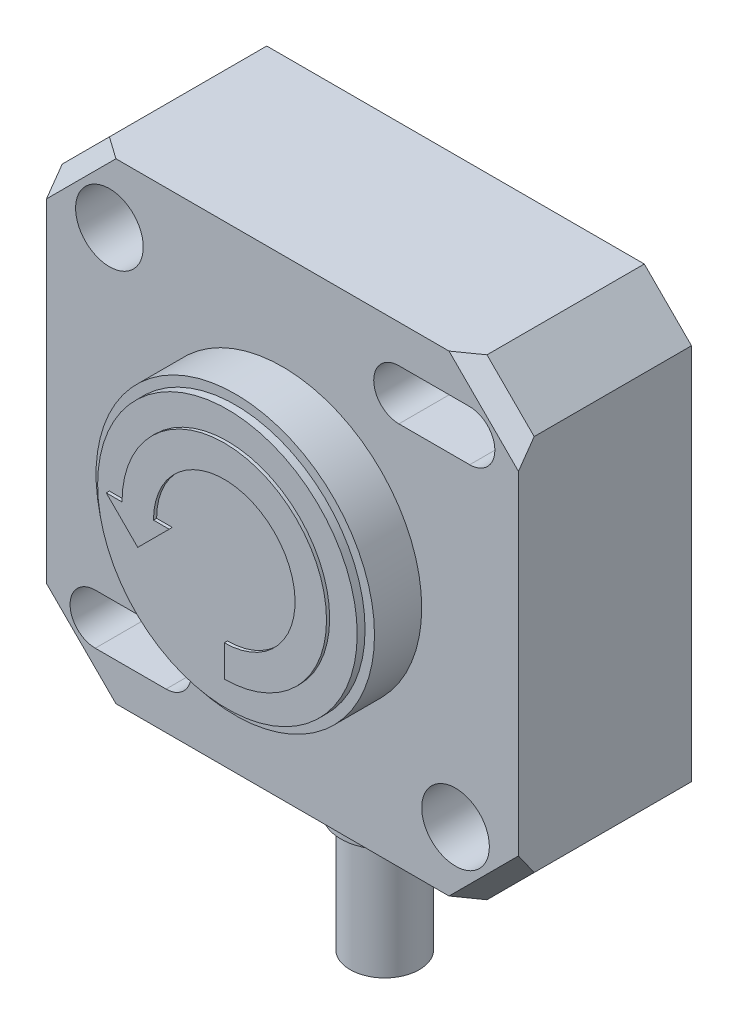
ISO-10303-21;
HEADER;
FILE_DESCRIPTION(('STEP AP214'),'2;1');
FILE_NAME('part.step','',(''),(''),'','','');
FILE_SCHEMA(('AUTOMOTIVE_DESIGN { 1 0 10303 214 1 1 1 1 }'));
ENDSEC;
DATA;
#1=APPLICATION_CONTEXT('core data for automotive mechanical design processes');
#2=APPLICATION_PROTOCOL_DEFINITION('international standard','automotive_design',2000,#1);
#3=PRODUCT_CONTEXT('',#1,'mechanical');
#4=PRODUCT('Part','Part','',(#3));
#5=PRODUCT_RELATED_PRODUCT_CATEGORY('part','',(#4));
#6=PRODUCT_DEFINITION_FORMATION('','',#4);
#7=PRODUCT_DEFINITION_CONTEXT('part definition',#1,'design');
#8=PRODUCT_DEFINITION('design','',#6,#7);
#9=PRODUCT_DEFINITION_SHAPE('','',#8);
#10=(LENGTH_UNIT() NAMED_UNIT(*) SI_UNIT(.MILLI.,.METRE.));
#11=(NAMED_UNIT(*) PLANE_ANGLE_UNIT() SI_UNIT($,.RADIAN.));
#12=(NAMED_UNIT(*) SI_UNIT($,.STERADIAN.) SOLID_ANGLE_UNIT());
#13=UNCERTAINTY_MEASURE_WITH_UNIT(LENGTH_MEASURE(1.E-05),#10,'distance_accuracy_value','');
#14=(GEOMETRIC_REPRESENTATION_CONTEXT(3) GLOBAL_UNCERTAINTY_ASSIGNED_CONTEXT((#13)) GLOBAL_UNIT_ASSIGNED_CONTEXT((#10,
#11,#12)) REPRESENTATION_CONTEXT('',''));
#15=CARTESIAN_POINT('',(0.,0.,0.));
#16=DIRECTION('',(0.,0.,1.));
#17=DIRECTION('',(1.,0.,0.));
#18=AXIS2_PLACEMENT_3D('',#15,#16,#17);
#19=CARTESIAN_POINT('',(0.,0.,14.7));
#20=DIRECTION('',(0.,0.,1.));
#21=DIRECTION('',(1.,0.,0.));
#22=AXIS2_PLACEMENT_3D('',#19,#20,#21);
#23=PLANE('',#22);
#24=DIRECTION('',(-1.,0.,0.));
#25=VECTOR('',#24,1.);
#26=CARTESIAN_POINT('',(-4.5,0.,14.7));
#27=LINE('',#26,#25);
#28=CARTESIAN_POINT('',(-4.5,0.,14.7));
#29=VERTEX_POINT('',#28);
#30=CARTESIAN_POINT('',(-3.5,0.,14.7));
#31=VERTEX_POINT('',#30);
#32=EDGE_CURVE('E110',#29,#31,#27,.F.);
#33=ORIENTED_EDGE('',*,*,#32,.F.);
#34=CARTESIAN_POINT('',(0.,0.,14.7));
#35=DIRECTION('',(0.,0.,1.));
#36=DIRECTION('',(1.,0.,0.));
#37=AXIS2_PLACEMENT_3D('',#34,#35,#36);
#38=CIRCLE('',#37,4.5);
#39=CARTESIAN_POINT('',(0.,-4.5,14.7));
#40=VERTEX_POINT('',#39);
#41=EDGE_CURVE('E19',#29,#40,#38,.F.);
#42=ORIENTED_EDGE('',*,*,#41,.T.);
#43=DIRECTION('',(0.,1.,0.));
#44=VECTOR('',#43,1.);
#45=CARTESIAN_POINT('',(0.,-4.5,14.7));
#46=LINE('',#45,#44);
#47=CARTESIAN_POINT('',(0.,-6.5,14.7));
#48=VERTEX_POINT('',#47);
#49=EDGE_CURVE('E158',#48,#40,#46,.T.);
#50=ORIENTED_EDGE('',*,*,#49,.F.);
#51=CARTESIAN_POINT('',(0.,0.,14.7));
#52=DIRECTION('',(0.,0.,1.));
#53=DIRECTION('',(1.,0.,0.));
#54=AXIS2_PLACEMENT_3D('',#51,#52,#53);
#55=CIRCLE('',#54,6.5);
#56=CARTESIAN_POINT('',(-6.5,0.,14.7));
#57=VERTEX_POINT('',#56);
#58=EDGE_CURVE('E143',#57,#48,#55,.F.);
#59=ORIENTED_EDGE('',*,*,#58,.F.);
#60=DIRECTION('',(-1.,0.,0.));
#61=VECTOR('',#60,1.);
#62=CARTESIAN_POINT('',(-6.5,0.,14.7));
#63=LINE('',#62,#61);
#64=CARTESIAN_POINT('',(-7.5,0.,14.7));
#65=VERTEX_POINT('',#64);
#66=EDGE_CURVE('E139',#65,#57,#63,.F.);
#67=ORIENTED_EDGE('',*,*,#66,.F.);
#68=DIRECTION('',(0.707106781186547,-0.707106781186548,0.));
#69=VECTOR('',#68,1.);
#70=CARTESIAN_POINT('',(-7.5,0.,14.7));
#71=LINE('',#70,#69);
#72=CARTESIAN_POINT('',(-5.5,-2.,14.7));
#73=VERTEX_POINT('',#72);
#74=EDGE_CURVE('E130',#73,#65,#71,.F.);
#75=ORIENTED_EDGE('',*,*,#74,.F.);
#76=DIRECTION('',(0.707106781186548,0.707106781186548,0.));
#77=VECTOR('',#76,1.);
#78=CARTESIAN_POINT('',(-3.5,0.,14.7));
#79=LINE('',#78,#77);
#80=EDGE_CURVE('E151',#31,#73,#79,.F.);
#81=ORIENTED_EDGE('',*,*,#80,.F.);
#82=EDGE_LOOP('',(#33,#42,#50,#59,#67,#75,#81));
#83=FACE_BOUND('',#82,.T.);
#84=ADVANCED_FACE('F16',(#83),#23,.T.);
#85=CARTESIAN_POINT('',(-6.5,0.,14.7));
#86=DIRECTION('',(0.,1.,0.));
#87=DIRECTION('',(-1.,0.,0.));
#88=AXIS2_PLACEMENT_3D('',#85,#86,#87);
#89=PLANE('',#88);
#90=ORIENTED_EDGE('',*,*,#66,.T.);
#91=DIRECTION('',(0.,0.,1.));
#92=VECTOR('',#91,1.);
#93=CARTESIAN_POINT('',(-6.5,0.,14.7));
#94=LINE('',#93,#92);
#95=CARTESIAN_POINT('',(-6.5,0.,14.5));
#96=VERTEX_POINT('',#95);
#97=EDGE_CURVE('E259',#96,#57,#94,.T.);
#98=ORIENTED_EDGE('',*,*,#97,.F.);
#99=DIRECTION('',(-1.,0.,0.));
#100=VECTOR('',#99,1.);
#101=CARTESIAN_POINT('',(0.,0.,14.5));
#102=LINE('',#101,#100);
#103=CARTESIAN_POINT('',(-7.5,0.,14.5));
#104=VERTEX_POINT('',#103);
#105=EDGE_CURVE('E150',#96,#104,#102,.T.);
#106=ORIENTED_EDGE('',*,*,#105,.T.);
#107=DIRECTION('',(0.,0.,1.));
#108=VECTOR('',#107,1.);
#109=CARTESIAN_POINT('',(-7.5,0.,14.7));
#110=LINE('',#109,#108);
#111=EDGE_CURVE('E135',#65,#104,#110,.F.);
#112=ORIENTED_EDGE('',*,*,#111,.F.);
#113=EDGE_LOOP('',(#90,#98,#106,#112));
#114=FACE_BOUND('',#113,.T.);
#115=ADVANCED_FACE('F149',(#114),#89,.T.);
#116=CARTESIAN_POINT('',(-7.5,0.,14.7));
#117=DIRECTION('',(-0.707106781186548,-0.707106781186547,0.));
#118=DIRECTION('',(0.707106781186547,-0.707106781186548,0.));
#119=AXIS2_PLACEMENT_3D('',#116,#117,#118);
#120=PLANE('',#119);
#121=ORIENTED_EDGE('',*,*,#74,.T.);
#122=ORIENTED_EDGE('',*,*,#111,.T.);
#123=DIRECTION('',(0.707106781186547,-0.707106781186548,0.));
#124=VECTOR('',#123,1.);
#125=CARTESIAN_POINT('',(-7.5,0.,14.5));
#126=LINE('',#125,#124);
#127=CARTESIAN_POINT('',(-5.5,-2.,14.5));
#128=VERTEX_POINT('',#127);
#129=EDGE_CURVE('E156',#104,#128,#126,.T.);
#130=ORIENTED_EDGE('',*,*,#129,.T.);
#131=DIRECTION('',(0.,0.,1.));
#132=VECTOR('',#131,1.);
#133=CARTESIAN_POINT('',(-5.5,-2.,14.7));
#134=LINE('',#133,#132);
#135=EDGE_CURVE('E138',#73,#128,#134,.F.);
#136=ORIENTED_EDGE('',*,*,#135,.F.);
#137=EDGE_LOOP('',(#121,#122,#130,#136));
#138=FACE_BOUND('',#137,.T.);
#139=ADVANCED_FACE('F132',(#138),#120,.T.);
#140=CARTESIAN_POINT('',(-3.5,0.,14.7));
#141=DIRECTION('',(0.707106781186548,-0.707106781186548,0.));
#142=DIRECTION('',(0.707106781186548,0.707106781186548,0.));
#143=AXIS2_PLACEMENT_3D('',#140,#141,#142);
#144=PLANE('',#143);
#145=ORIENTED_EDGE('',*,*,#80,.T.);
#146=ORIENTED_EDGE('',*,*,#135,.T.);
#147=DIRECTION('',(0.707106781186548,0.707106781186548,0.));
#148=VECTOR('',#147,1.);
#149=CARTESIAN_POINT('',(-5.5,-2.,14.5));
#150=LINE('',#149,#148);
#151=CARTESIAN_POINT('',(-3.5,0.,14.5));
#152=VERTEX_POINT('',#151);
#153=EDGE_CURVE('E269',#128,#152,#150,.T.);
#154=ORIENTED_EDGE('',*,*,#153,.T.);
#155=DIRECTION('',(0.,0.,1.));
#156=VECTOR('',#155,1.);
#157=CARTESIAN_POINT('',(-3.5,0.,14.7));
#158=LINE('',#157,#156);
#159=EDGE_CURVE('E161',#31,#152,#158,.F.);
#160=ORIENTED_EDGE('',*,*,#159,.F.);
#161=EDGE_LOOP('',(#145,#146,#154,#160));
#162=FACE_BOUND('',#161,.T.);
#163=ADVANCED_FACE('F273',(#162),#144,.T.);
#164=CARTESIAN_POINT('',(-4.5,0.,14.7));
#165=DIRECTION('',(0.,1.,0.));
#166=DIRECTION('',(-1.,0.,0.));
#167=AXIS2_PLACEMENT_3D('',#164,#165,#166);
#168=PLANE('',#167);
#169=ORIENTED_EDGE('',*,*,#32,.T.);
#170=ORIENTED_EDGE('',*,*,#159,.T.);
#171=DIRECTION('',(-1.,0.,0.));
#172=VECTOR('',#171,1.);
#173=CARTESIAN_POINT('',(0.,0.,14.5));
#174=LINE('',#173,#172);
#175=CARTESIAN_POINT('',(-4.5,0.,14.5));
#176=VERTEX_POINT('',#175);
#177=EDGE_CURVE('E257',#152,#176,#174,.T.);
#178=ORIENTED_EDGE('',*,*,#177,.T.);
#179=DIRECTION('',(0.,0.,1.));
#180=VECTOR('',#179,1.);
#181=CARTESIAN_POINT('',(-4.5,0.,14.7));
#182=LINE('',#181,#180);
#183=EDGE_CURVE('E266',#176,#29,#182,.T.);
#184=ORIENTED_EDGE('',*,*,#183,.T.);
#185=EDGE_LOOP('',(#169,#170,#178,#184));
#186=FACE_BOUND('',#185,.T.);
#187=ADVANCED_FACE('F633',(#186),#168,.T.);
#188=CARTESIAN_POINT('',(0.,0.,14.7));
#189=DIRECTION('',(0.,0.,1.));
#190=DIRECTION('',(1.,0.,0.));
#191=AXIS2_PLACEMENT_3D('',#188,#189,#190);
#192=CYLINDRICAL_SURFACE('',#191,4.5);
#193=DIRECTION('',(0.,0.,1.));
#194=VECTOR('',#193,1.);
#195=CARTESIAN_POINT('',(0.,-4.5,14.7));
#196=LINE('',#195,#194);
#197=CARTESIAN_POINT('',(0.,-4.5,14.5));
#198=VERTEX_POINT('',#197);
#199=EDGE_CURVE('E159',#40,#198,#196,.F.);
#200=ORIENTED_EDGE('',*,*,#199,.F.);
#201=ORIENTED_EDGE('',*,*,#41,.F.);
#202=ORIENTED_EDGE('',*,*,#183,.F.);
#203=CARTESIAN_POINT('',(0.,0.,14.5));
#204=DIRECTION('',(0.,0.,1.));
#205=DIRECTION('',(1.,0.,0.));
#206=AXIS2_PLACEMENT_3D('',#203,#204,#205);
#207=CIRCLE('',#206,4.5);
#208=EDGE_CURVE('E255',#176,#198,#207,.F.);
#209=ORIENTED_EDGE('',*,*,#208,.T.);
#210=EDGE_LOOP('',(#200,#201,#202,#209));
#211=FACE_BOUND('',#210,.T.);
#212=ADVANCED_FACE('F636',(#211),#192,.F.);
#213=CARTESIAN_POINT('',(0.,-4.5,14.7));
#214=DIRECTION('',(-1.,0.,0.));
#215=DIRECTION('',(0.,0.,1.));
#216=AXIS2_PLACEMENT_3D('',#213,#214,#215);
#217=PLANE('',#216);
#218=ORIENTED_EDGE('',*,*,#49,.T.);
#219=ORIENTED_EDGE('',*,*,#199,.T.);
#220=DIRECTION('',(0.,1.,0.));
#221=VECTOR('',#220,1.);
#222=CARTESIAN_POINT('',(0.,0.,14.5));
#223=LINE('',#222,#221);
#224=CARTESIAN_POINT('',(0.,-6.5,14.5));
#225=VERTEX_POINT('',#224);
#226=EDGE_CURVE('E254',#198,#225,#223,.F.);
#227=ORIENTED_EDGE('',*,*,#226,.T.);
#228=DIRECTION('',(0.,0.,1.));
#229=VECTOR('',#228,1.);
#230=CARTESIAN_POINT('',(0.,-6.5,14.7));
#231=LINE('',#230,#229);
#232=EDGE_CURVE('E258',#48,#225,#231,.F.);
#233=ORIENTED_EDGE('',*,*,#232,.F.);
#234=EDGE_LOOP('',(#218,#219,#227,#233));
#235=FACE_BOUND('',#234,.T.);
#236=ADVANCED_FACE('F640',(#235),#217,.T.);
#237=CARTESIAN_POINT('',(0.,0.,14.7));
#238=DIRECTION('',(0.,0.,1.));
#239=DIRECTION('',(1.,0.,0.));
#240=AXIS2_PLACEMENT_3D('',#237,#238,#239);
#241=CYLINDRICAL_SURFACE('',#240,6.5);
#242=ORIENTED_EDGE('',*,*,#58,.T.);
#243=ORIENTED_EDGE('',*,*,#232,.T.);
#244=CARTESIAN_POINT('',(0.,0.,14.5));
#245=DIRECTION('',(0.,0.,1.));
#246=DIRECTION('',(1.,0.,0.));
#247=AXIS2_PLACEMENT_3D('',#244,#245,#246);
#248=CIRCLE('',#247,6.5);
#249=EDGE_CURVE('E251',#225,#96,#248,.T.);
#250=ORIENTED_EDGE('',*,*,#249,.T.);
#251=ORIENTED_EDGE('',*,*,#97,.T.);
#252=EDGE_LOOP('',(#242,#243,#250,#251));
#253=FACE_BOUND('',#252,.T.);
#254=ADVANCED_FACE('F641',(#253),#241,.T.);
#255=CARTESIAN_POINT('',(0.,0.,14.5));
#256=DIRECTION('',(0.,0.,-1.));
#257=DIRECTION('',(-1.,0.,0.));
#258=AXIS2_PLACEMENT_3D('',#255,#256,#257);
#259=PLANE('',#258);
#260=CARTESIAN_POINT('',(0.,0.,14.5));
#261=DIRECTION('',(0.,0.,1.));
#262=DIRECTION('',(1.,0.,0.));
#263=AXIS2_PLACEMENT_3D('',#260,#261,#262);
#264=CIRCLE('',#263,8.25);
#265=CARTESIAN_POINT('',(8.25,0.,14.5));
#266=VERTEX_POINT('',#265);
#267=EDGE_CURVE('E248',#266,#266,#264,.F.);
#268=ORIENTED_EDGE('',*,*,#267,.F.);
#269=EDGE_LOOP('',(#268));
#270=FACE_BOUND('',#269,.T.);
#271=ORIENTED_EDGE('',*,*,#226,.F.);
#272=ORIENTED_EDGE('',*,*,#208,.F.);
#273=ORIENTED_EDGE('',*,*,#177,.F.);
#274=ORIENTED_EDGE('',*,*,#153,.F.);
#275=ORIENTED_EDGE('',*,*,#129,.F.);
#276=ORIENTED_EDGE('',*,*,#105,.F.);
#277=ORIENTED_EDGE('',*,*,#249,.F.);
#278=EDGE_LOOP('',(#271,#272,#273,#274,#275,#276,#277));
#279=FACE_BOUND('',#278,.T.);
#280=ADVANCED_FACE('F278',(#270,#279),#259,.F.);
#281=CARTESIAN_POINT('',(0.,-26.5,4.5));
#282=DIRECTION('',(0.,1.,0.));
#283=DIRECTION('',(0.,0.,1.));
#284=AXIS2_PLACEMENT_3D('',#281,#282,#283);
#285=PLANE('',#284);
#286=CARTESIAN_POINT('',(0.,-26.5,4.5));
#287=DIRECTION('',(0.,-1.,0.));
#288=DIRECTION('',(0.,0.,-1.));
#289=AXIS2_PLACEMENT_3D('',#286,#287,#288);
#290=CIRCLE('',#289,2.2);
#291=CARTESIAN_POINT('',(0.,-26.5,2.3));
#292=VERTEX_POINT('',#291);
#293=EDGE_CURVE('E245',#292,#292,#290,.F.);
#294=ORIENTED_EDGE('',*,*,#293,.F.);
#295=EDGE_LOOP('',(#294));
#296=FACE_BOUND('',#295,.T.);
#297=ADVANCED_FACE('F648',(#296),#285,.F.);
#298=CARTESIAN_POINT('',(0.,0.,14.5));
#299=DIRECTION('',(0.,0.,1.));
#300=DIRECTION('',(1.,0.,0.));
#301=AXIS2_PLACEMENT_3D('',#298,#299,#300);
#302=CYLINDRICAL_SURFACE('',#301,8.25);
#303=CARTESIAN_POINT('',(0.,0.,14.));
#304=DIRECTION('',(0.,0.,1.));
#305=DIRECTION('',(1.,0.,0.));
#306=AXIS2_PLACEMENT_3D('',#303,#304,#305);
#307=CIRCLE('',#306,8.25);
#308=CARTESIAN_POINT('',(8.25,0.,14.));
#309=VERTEX_POINT('',#308);
#310=EDGE_CURVE('E242',#309,#309,#307,.T.);
#311=ORIENTED_EDGE('',*,*,#310,.T.);
#312=EDGE_LOOP('',(#311));
#313=FACE_BOUND('',#312,.T.);
#314=ORIENTED_EDGE('',*,*,#267,.T.);
#315=EDGE_LOOP('',(#314));
#316=FACE_BOUND('',#315,.T.);
#317=ADVANCED_FACE('F725',(#313,#316),#302,.T.);
#318=CARTESIAN_POINT('',(0.,-26.5,4.5));
#319=DIRECTION('',(0.,-1.,0.));
#320=DIRECTION('',(0.,0.,-1.));
#321=AXIS2_PLACEMENT_3D('',#318,#319,#320);
#322=CYLINDRICAL_SURFACE('',#321,2.2);
#323=CARTESIAN_POINT('',(0.,-19.,4.5));
#324=DIRECTION('',(0.,-1.,0.));
#325=DIRECTION('',(0.,0.,-1.));
#326=AXIS2_PLACEMENT_3D('',#323,#324,#325);
#327=CIRCLE('',#326,2.2);
#328=CARTESIAN_POINT('',(0.,-19.,2.3));
#329=VERTEX_POINT('',#328);
#330=EDGE_CURVE('E239',#329,#329,#327,.T.);
#331=ORIENTED_EDGE('',*,*,#330,.T.);
#332=EDGE_LOOP('',(#331));
#333=FACE_BOUND('',#332,.T.);
#334=ORIENTED_EDGE('',*,*,#293,.T.);
#335=EDGE_LOOP('',(#334));
#336=FACE_BOUND('',#335,.T.);
#337=ADVANCED_FACE('F734',(#333,#336),#322,.T.);
#338=CARTESIAN_POINT('',(0.,0.,14.));
#339=DIRECTION('',(0.,0.,-1.));
#340=DIRECTION('',(-1.,0.,0.));
#341=AXIS2_PLACEMENT_3D('',#338,#339,#340);
#342=PLANE('',#341);
#343=CARTESIAN_POINT('',(0.,0.,14.));
#344=DIRECTION('',(0.,0.,1.));
#345=DIRECTION('',(1.,0.,0.));
#346=AXIS2_PLACEMENT_3D('',#343,#344,#345);
#347=CIRCLE('',#346,8.85);
#348=CARTESIAN_POINT('',(8.85,0.,14.));
#349=VERTEX_POINT('',#348);
#350=EDGE_CURVE('E236',#349,#349,#347,.F.);
#351=ORIENTED_EDGE('',*,*,#350,.F.);
#352=EDGE_LOOP('',(#351));
#353=FACE_BOUND('',#352,.T.);
#354=ORIENTED_EDGE('',*,*,#310,.F.);
#355=EDGE_LOOP('',(#354));
#356=FACE_BOUND('',#355,.T.);
#357=ADVANCED_FACE('F744',(#353,#356),#342,.F.);
#358=CARTESIAN_POINT('',(0.,-19.,4.5));
#359=DIRECTION('',(0.,1.,0.));
#360=DIRECTION('',(0.,0.,1.));
#361=AXIS2_PLACEMENT_3D('',#358,#359,#360);
#362=PLANE('',#361);
#363=CARTESIAN_POINT('',(0.,-19.,4.5));
#364=DIRECTION('',(0.,-1.,0.));
#365=DIRECTION('',(0.,0.,-1.));
#366=AXIS2_PLACEMENT_3D('',#363,#364,#365);
#367=CIRCLE('',#366,2.8);
#368=CARTESIAN_POINT('',(0.,-19.,1.7));
#369=VERTEX_POINT('',#368);
#370=EDGE_CURVE('E225',#369,#369,#367,.F.);
#371=ORIENTED_EDGE('',*,*,#370,.F.);
#372=EDGE_LOOP('',(#371));
#373=FACE_BOUND('',#372,.T.);
#374=ORIENTED_EDGE('',*,*,#330,.F.);
#375=EDGE_LOOP('',(#374));
#376=FACE_BOUND('',#375,.T.);
#377=ADVANCED_FACE('F450',(#373,#376),#362,.F.);
#378=CARTESIAN_POINT('',(-11.,11.,11.));
#379=DIRECTION('',(0.,0.,1.));
#380=DIRECTION('',(1.,0.,0.));
#381=AXIS2_PLACEMENT_3D('',#378,#379,#380);
#382=CYLINDRICAL_SURFACE('',#381,2.15);
#383=CARTESIAN_POINT('',(-11.,11.,11.));
#384=DIRECTION('',(0.,0.,1.));
#385=DIRECTION('',(1.,0.,0.));
#386=AXIS2_PLACEMENT_3D('',#383,#384,#385);
#387=CIRCLE('',#386,2.15);
#388=CARTESIAN_POINT('',(-8.85,11.,11.));
#389=VERTEX_POINT('',#388);
#390=EDGE_CURVE('E222',#389,#389,#387,.F.);
#391=ORIENTED_EDGE('',*,*,#390,.F.);
#392=EDGE_LOOP('',(#391));
#393=FACE_BOUND('',#392,.T.);
#394=CARTESIAN_POINT('',(-11.,11.,4.5));
#395=DIRECTION('',(0.,0.,1.));
#396=DIRECTION('',(1.,0.,0.));
#397=AXIS2_PLACEMENT_3D('',#394,#395,#396);
#398=CIRCLE('',#397,2.15);
#399=CARTESIAN_POINT('',(-8.85,11.,4.5));
#400=VERTEX_POINT('',#399);
#401=EDGE_CURVE('E233',#400,#400,#398,.F.);
#402=ORIENTED_EDGE('',*,*,#401,.T.);
#403=EDGE_LOOP('',(#402));
#404=FACE_BOUND('',#403,.T.);
#405=ADVANCED_FACE('F446',(#393,#404),#382,.F.);
#406=CARTESIAN_POINT('',(11.,-11.,11.));
#407=DIRECTION('',(0.,0.,1.));
#408=DIRECTION('',(1.,0.,0.));
#409=AXIS2_PLACEMENT_3D('',#406,#407,#408);
#410=CYLINDRICAL_SURFACE('',#409,2.15);
#411=CARTESIAN_POINT('',(11.,-11.,11.));
#412=DIRECTION('',(0.,0.,1.));
#413=DIRECTION('',(1.,0.,0.));
#414=AXIS2_PLACEMENT_3D('',#411,#412,#413);
#415=CIRCLE('',#414,2.15);
#416=CARTESIAN_POINT('',(13.15,-11.,11.));
#417=VERTEX_POINT('',#416);
#418=EDGE_CURVE('E219',#417,#417,#415,.F.);
#419=ORIENTED_EDGE('',*,*,#418,.F.);
#420=EDGE_LOOP('',(#419));
#421=FACE_BOUND('',#420,.T.);
#422=CARTESIAN_POINT('',(11.,-11.,4.5));
#423=DIRECTION('',(0.,0.,1.));
#424=DIRECTION('',(1.,0.,0.));
#425=AXIS2_PLACEMENT_3D('',#422,#423,#424);
#426=CIRCLE('',#425,2.15);
#427=CARTESIAN_POINT('',(13.15,-11.,4.5));
#428=VERTEX_POINT('',#427);
#429=EDGE_CURVE('E229',#428,#428,#426,.F.);
#430=ORIENTED_EDGE('',*,*,#429,.T.);
#431=EDGE_LOOP('',(#430));
#432=FACE_BOUND('',#431,.T.);
#433=ADVANCED_FACE('F449',(#421,#432),#410,.F.);
#434=CARTESIAN_POINT('',(0.,0.,14.));
#435=DIRECTION('',(0.,0.,1.));
#436=DIRECTION('',(1.,0.,0.));
#437=AXIS2_PLACEMENT_3D('',#434,#435,#436);
#438=CYLINDRICAL_SURFACE('',#437,8.85);
#439=CARTESIAN_POINT('',(0.,0.,11.));
#440=DIRECTION('',(0.,0.,1.));
#441=DIRECTION('',(1.,0.,0.));
#442=AXIS2_PLACEMENT_3D('',#439,#440,#441);
#443=CIRCLE('',#442,8.85);
#444=CARTESIAN_POINT('',(8.85,0.,11.));
#445=VERTEX_POINT('',#444);
#446=EDGE_CURVE('E215',#445,#445,#443,.F.);
#447=ORIENTED_EDGE('',*,*,#446,.F.);
#448=EDGE_LOOP('',(#447));
#449=FACE_BOUND('',#448,.T.);
#450=ORIENTED_EDGE('',*,*,#350,.T.);
#451=EDGE_LOOP('',(#450));
#452=FACE_BOUND('',#451,.T.);
#453=ADVANCED_FACE('F457',(#449,#452),#438,.T.);
#454=CARTESIAN_POINT('',(-11.,11.,4.5));
#455=DIRECTION('',(0.,0.,-1.));
#456=DIRECTION('',(-1.,0.,0.));
#457=AXIS2_PLACEMENT_3D('',#454,#455,#456);
#458=PLANE('',#457);
#459=CARTESIAN_POINT('',(-11.,11.,4.5));
#460=DIRECTION('',(0.,0.,-1.));
#461=DIRECTION('',(-1.,0.,0.));
#462=AXIS2_PLACEMENT_3D('',#459,#460,#461);
#463=CIRCLE('',#462,1.35);
#464=CARTESIAN_POINT('',(-12.35,11.,4.5));
#465=VERTEX_POINT('',#464);
#466=EDGE_CURVE('E211',#465,#465,#463,.T.);
#467=ORIENTED_EDGE('',*,*,#466,.T.);
#468=EDGE_LOOP('',(#467));
#469=FACE_BOUND('',#468,.T.);
#470=ORIENTED_EDGE('',*,*,#401,.F.);
#471=EDGE_LOOP('',(#470));
#472=FACE_BOUND('',#471,.T.);
#473=ADVANCED_FACE('F454',(#469,#472),#458,.F.);
#474=CARTESIAN_POINT('',(11.,-11.,4.5));
#475=DIRECTION('',(0.,0.,-1.));
#476=DIRECTION('',(-1.,0.,0.));
#477=AXIS2_PLACEMENT_3D('',#474,#475,#476);
#478=PLANE('',#477);
#479=CARTESIAN_POINT('',(11.,-11.,4.5));
#480=DIRECTION('',(0.,0.,-1.));
#481=DIRECTION('',(-1.,0.,0.));
#482=AXIS2_PLACEMENT_3D('',#479,#480,#481);
#483=CIRCLE('',#482,1.35);
#484=CARTESIAN_POINT('',(9.65,-11.,4.5));
#485=VERTEX_POINT('',#484);
#486=EDGE_CURVE('E208',#485,#485,#483,.T.);
#487=ORIENTED_EDGE('',*,*,#486,.T.);
#488=EDGE_LOOP('',(#487));
#489=FACE_BOUND('',#488,.T.);
#490=ORIENTED_EDGE('',*,*,#429,.F.);
#491=EDGE_LOOP('',(#490));
#492=FACE_BOUND('',#491,.T.);
#493=ADVANCED_FACE('F456',(#489,#492),#478,.F.);
#494=CARTESIAN_POINT('',(12.7928932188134,-12.7928932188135,11.));
#495=DIRECTION('',(0.5,-0.5,0.707106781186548));
#496=DIRECTION('',(0.816496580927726,0.,-0.577350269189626));
#497=AXIS2_PLACEMENT_3D('',#494,#495,#496);
#498=PLANE('',#497);
#499=DIRECTION('',(0.,0.816496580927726,0.577350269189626));
#500=VECTOR('',#499,1.);
#501=CARTESIAN_POINT('',(15.,-12.,10.));
#502=LINE('',#501,#500);
#503=CARTESIAN_POINT('',(15.,-12.,10.));
#504=VERTEX_POINT('',#503);
#505=CARTESIAN_POINT('',(15.,-10.5857864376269,11.));
#506=VERTEX_POINT('',#505);
#507=EDGE_CURVE('E292',#504,#506,#502,.T.);
#508=ORIENTED_EDGE('',*,*,#507,.T.);
#509=DIRECTION('',(0.707106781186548,0.707106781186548,0.));
#510=VECTOR('',#509,1.);
#511=CARTESIAN_POINT('',(10.5857864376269,-15.,11.));
#512=LINE('',#511,#510);
#513=CARTESIAN_POINT('',(10.5857864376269,-15.,11.));
#514=VERTEX_POINT('',#513);
#515=EDGE_CURVE('E218',#514,#506,#512,.T.);
#516=ORIENTED_EDGE('',*,*,#515,.F.);
#517=DIRECTION('',(0.816496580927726,0.,-0.577350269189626));
#518=VECTOR('',#517,1.);
#519=CARTESIAN_POINT('',(12.0571909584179,-15.,9.95955988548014));
#520=LINE('',#519,#518);
#521=CARTESIAN_POINT('',(12.,-15.,10.));
#522=VERTEX_POINT('',#521);
#523=EDGE_CURVE('E232',#514,#522,#520,.T.);
#524=ORIENTED_EDGE('',*,*,#523,.T.);
#525=DIRECTION('',(-0.707106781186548,-0.707106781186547,0.));
#526=VECTOR('',#525,1.);
#527=CARTESIAN_POINT('',(15.,-12.,10.));
#528=LINE('',#527,#526);
#529=EDGE_CURVE('E323',#522,#504,#528,.F.);
#530=ORIENTED_EDGE('',*,*,#529,.T.);
#531=EDGE_LOOP('',(#508,#516,#524,#530));
#532=FACE_BOUND('',#531,.T.);
#533=ADVANCED_FACE('F465',(#532),#498,.T.);
#534=CARTESIAN_POINT('',(12.7928932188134,12.7928932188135,11.));
#535=DIRECTION('',(0.5,0.5,0.707106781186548));
#536=DIRECTION('',(0.816496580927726,0.,-0.577350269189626));
#537=AXIS2_PLACEMENT_3D('',#534,#535,#536);
#538=PLANE('',#537);
#539=DIRECTION('',(0.816496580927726,0.,-0.577350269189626));
#540=VECTOR('',#539,1.);
#541=CARTESIAN_POINT('',(12.0571909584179,15.,9.95955988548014));
#542=LINE('',#541,#540);
#543=CARTESIAN_POINT('',(12.,15.,10.));
#544=VERTEX_POINT('',#543);
#545=CARTESIAN_POINT('',(10.5857864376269,15.,11.));
#546=VERTEX_POINT('',#545);
#547=EDGE_CURVE('E295',#544,#546,#542,.F.);
#548=ORIENTED_EDGE('',*,*,#547,.T.);
#549=DIRECTION('',(-0.707106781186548,0.707106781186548,0.));
#550=VECTOR('',#549,1.);
#551=CARTESIAN_POINT('',(15.,10.5857864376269,11.));
#552=LINE('',#551,#550);
#553=CARTESIAN_POINT('',(15.,10.5857864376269,11.));
#554=VERTEX_POINT('',#553);
#555=EDGE_CURVE('E307',#554,#546,#552,.T.);
#556=ORIENTED_EDGE('',*,*,#555,.F.);
#557=DIRECTION('',(0.,0.816496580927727,-0.577350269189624));
#558=VECTOR('',#557,1.);
#559=CARTESIAN_POINT('',(15.,10.5857864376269,11.));
#560=LINE('',#559,#558);
#561=CARTESIAN_POINT('',(15.,12.,10.));
#562=VERTEX_POINT('',#561);
#563=EDGE_CURVE('E326',#554,#562,#560,.T.);
#564=ORIENTED_EDGE('',*,*,#563,.T.);
#565=DIRECTION('',(0.707106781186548,-0.707106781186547,0.));
#566=VECTOR('',#565,1.);
#567=CARTESIAN_POINT('',(12.,15.,10.));
#568=LINE('',#567,#566);
#569=EDGE_CURVE('E338',#562,#544,#568,.F.);
#570=ORIENTED_EDGE('',*,*,#569,.T.);
#571=EDGE_LOOP('',(#548,#556,#564,#570));
#572=FACE_BOUND('',#571,.T.);
#573=ADVANCED_FACE('F548',(#572),#538,.T.);
#574=CARTESIAN_POINT('',(-12.7928932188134,12.7928932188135,11.));
#575=DIRECTION('',(-0.5,0.5,0.707106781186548));
#576=DIRECTION('',(0.816496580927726,0.,0.577350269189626));
#577=AXIS2_PLACEMENT_3D('',#574,#575,#576);
#578=PLANE('',#577);
#579=DIRECTION('',(0.,-0.816496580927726,0.577350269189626));
#580=VECTOR('',#579,1.);
#581=CARTESIAN_POINT('',(-15.,12.,10.));
#582=LINE('',#581,#580);
#583=CARTESIAN_POINT('',(-15.,12.,10.));
#584=VERTEX_POINT('',#583);
#585=CARTESIAN_POINT('',(-15.,10.5857864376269,11.));
#586=VERTEX_POINT('',#585);
#587=EDGE_CURVE('E298',#584,#586,#582,.T.);
#588=ORIENTED_EDGE('',*,*,#587,.T.);
#589=DIRECTION('',(-0.707106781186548,-0.707106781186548,0.));
#590=VECTOR('',#589,1.);
#591=CARTESIAN_POINT('',(-10.5857864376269,15.,11.));
#592=LINE('',#591,#590);
#593=CARTESIAN_POINT('',(-10.5857864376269,15.,11.));
#594=VERTEX_POINT('',#593);
#595=EDGE_CURVE('E310',#594,#586,#592,.T.);
#596=ORIENTED_EDGE('',*,*,#595,.F.);
#597=DIRECTION('',(-0.816496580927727,0.,-0.577350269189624));
#598=VECTOR('',#597,1.);
#599=CARTESIAN_POINT('',(-10.5857864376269,15.,11.));
#600=LINE('',#599,#598);
#601=CARTESIAN_POINT('',(-12.,15.,10.));
#602=VERTEX_POINT('',#601);
#603=EDGE_CURVE('E341',#594,#602,#600,.T.);
#604=ORIENTED_EDGE('',*,*,#603,.T.);
#605=DIRECTION('',(0.707106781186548,0.707106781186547,0.));
#606=VECTOR('',#605,1.);
#607=CARTESIAN_POINT('',(-15.,12.,10.));
#608=LINE('',#607,#606);
#609=EDGE_CURVE('E353',#602,#584,#608,.F.);
#610=ORIENTED_EDGE('',*,*,#609,.T.);
#611=EDGE_LOOP('',(#588,#596,#604,#610));
#612=FACE_BOUND('',#611,.T.);
#613=ADVANCED_FACE('F544',(#612),#578,.T.);
#614=CARTESIAN_POINT('',(-12.7928932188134,-12.7928932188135,11.));
#615=DIRECTION('',(-0.5,-0.5,0.707106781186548));
#616=DIRECTION('',(0.816496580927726,0.,0.577350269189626));
#617=AXIS2_PLACEMENT_3D('',#614,#615,#616);
#618=PLANE('',#617);
#619=DIRECTION('',(0.816496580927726,0.,0.577350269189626));
#620=VECTOR('',#619,1.);
#621=CARTESIAN_POINT('',(-12.0571909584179,-15.,9.95955988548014));
#622=LINE('',#621,#620);
#623=CARTESIAN_POINT('',(-12.,-15.,10.));
#624=VERTEX_POINT('',#623);
#625=CARTESIAN_POINT('',(-10.5857864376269,-15.,11.));
#626=VERTEX_POINT('',#625);
#627=EDGE_CURVE('E228',#624,#626,#622,.T.);
#628=ORIENTED_EDGE('',*,*,#627,.T.);
#629=DIRECTION('',(0.707106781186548,-0.707106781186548,0.));
#630=VECTOR('',#629,1.);
#631=CARTESIAN_POINT('',(-15.,-10.5857864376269,11.));
#632=LINE('',#631,#630);
#633=CARTESIAN_POINT('',(-15.,-10.5857864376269,11.));
#634=VERTEX_POINT('',#633);
#635=EDGE_CURVE('E214',#634,#626,#632,.T.);
#636=ORIENTED_EDGE('',*,*,#635,.F.);
#637=DIRECTION('',(0.,-0.816496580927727,-0.577350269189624));
#638=VECTOR('',#637,1.);
#639=CARTESIAN_POINT('',(-15.,-10.5857864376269,11.));
#640=LINE('',#639,#638);
#641=CARTESIAN_POINT('',(-15.,-12.,10.));
#642=VERTEX_POINT('',#641);
#643=EDGE_CURVE('E356',#634,#642,#640,.T.);
#644=ORIENTED_EDGE('',*,*,#643,.T.);
#645=DIRECTION('',(-0.707106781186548,0.707106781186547,0.));
#646=VECTOR('',#645,1.);
#647=CARTESIAN_POINT('',(-12.,-15.,10.));
#648=LINE('',#647,#646);
#649=EDGE_CURVE('E198',#642,#624,#648,.F.);
#650=ORIENTED_EDGE('',*,*,#649,.T.);
#651=EDGE_LOOP('',(#628,#636,#644,#650));
#652=FACE_BOUND('',#651,.T.);
#653=ADVANCED_FACE('F540',(#652),#618,.T.);
#654=CARTESIAN_POINT('',(0.,-19.,4.5));
#655=DIRECTION('',(0.,-1.,0.));
#656=DIRECTION('',(0.,0.,-1.));
#657=AXIS2_PLACEMENT_3D('',#654,#655,#656);
#658=CYLINDRICAL_SURFACE('',#657,2.8);
#659=CARTESIAN_POINT('',(0.,-15.,4.5));
#660=DIRECTION('',(0.,-1.,0.));
#661=DIRECTION('',(0.,0.,-1.));
#662=AXIS2_PLACEMENT_3D('',#659,#660,#661);
#663=CIRCLE('',#662,2.8);
#664=CARTESIAN_POINT('',(0.,-15.,1.7));
#665=VERTEX_POINT('',#664);
#666=EDGE_CURVE('E194',#665,#665,#663,.T.);
#667=ORIENTED_EDGE('',*,*,#666,.T.);
#668=EDGE_LOOP('',(#667));
#669=FACE_BOUND('',#668,.T.);
#670=ORIENTED_EDGE('',*,*,#370,.T.);
#671=EDGE_LOOP('',(#670));
#672=FACE_BOUND('',#671,.T.);
#673=ADVANCED_FACE('F432',(#669,#672),#658,.T.);
#674=CARTESIAN_POINT('',(0.,0.,11.));
#675=DIRECTION('',(0.,0.,1.));
#676=DIRECTION('',(1.,0.,0.));
#677=AXIS2_PLACEMENT_3D('',#674,#675,#676);
#678=PLANE('',#677);
#679=CARTESIAN_POINT('',(-11.9,-11.,11.));
#680=DIRECTION('',(0.,0.,-1.));
#681=DIRECTION('',(-1.,0.,0.));
#682=AXIS2_PLACEMENT_3D('',#679,#680,#681);
#683=CIRCLE('',#682,1.6);
#684=CARTESIAN_POINT('',(-11.9,-12.6,11.));
#685=VERTEX_POINT('',#684);
#686=CARTESIAN_POINT('',(-11.9,-9.4,11.));
#687=VERTEX_POINT('',#686);
#688=EDGE_CURVE('E189',#685,#687,#683,.T.);
#689=ORIENTED_EDGE('',*,*,#688,.T.);
#690=DIRECTION('',(1.,0.,0.));
#691=VECTOR('',#690,1.);
#692=CARTESIAN_POINT('',(-11.9,-9.4,11.));
#693=LINE('',#692,#691);
#694=CARTESIAN_POINT('',(-7.4,-9.4,11.));
#695=VERTEX_POINT('',#694);
#696=EDGE_CURVE('E192',#695,#687,#693,.F.);
#697=ORIENTED_EDGE('',*,*,#696,.F.);
#698=CARTESIAN_POINT('',(-7.4,-11.,11.));
#699=DIRECTION('',(0.,0.,-1.));
#700=DIRECTION('',(-1.,0.,0.));
#701=AXIS2_PLACEMENT_3D('',#698,#699,#700);
#702=CIRCLE('',#701,1.6);
#703=CARTESIAN_POINT('',(-7.4,-12.6,11.));
#704=VERTEX_POINT('',#703);
#705=EDGE_CURVE('E184',#695,#704,#702,.T.);
#706=ORIENTED_EDGE('',*,*,#705,.T.);
#707=DIRECTION('',(-1.,0.,0.));
#708=VECTOR('',#707,1.);
#709=CARTESIAN_POINT('',(-11.9,-12.6,11.));
#710=LINE('',#709,#708);
#711=EDGE_CURVE('E315',#685,#704,#710,.F.);
#712=ORIENTED_EDGE('',*,*,#711,.F.);
#713=EDGE_LOOP('',(#689,#697,#706,#712));
#714=FACE_BOUND('',#713,.T.);
#715=DIRECTION('',(0.,1.,0.));
#716=VECTOR('',#715,1.);
#717=CARTESIAN_POINT('',(-15.,15.,11.));
#718=LINE('',#717,#716);
#719=EDGE_CURVE('E362',#586,#634,#718,.F.);
#720=ORIENTED_EDGE('',*,*,#719,.T.);
#721=ORIENTED_EDGE('',*,*,#635,.T.);
#722=DIRECTION('',(1.,0.,0.));
#723=VECTOR('',#722,1.);
#724=CARTESIAN_POINT('',(-15.,-15.,11.));
#725=LINE('',#724,#723);
#726=EDGE_CURVE('E372',#626,#514,#725,.T.);
#727=ORIENTED_EDGE('',*,*,#726,.T.);
#728=ORIENTED_EDGE('',*,*,#515,.T.);
#729=DIRECTION('',(0.,1.,0.));
#730=VECTOR('',#729,1.);
#731=CARTESIAN_POINT('',(15.,-15.,11.));
#732=LINE('',#731,#730);
#733=EDGE_CURVE('E332',#506,#554,#732,.T.);
#734=ORIENTED_EDGE('',*,*,#733,.T.);
#735=ORIENTED_EDGE('',*,*,#555,.T.);
#736=DIRECTION('',(1.,0.,0.));
#737=VECTOR('',#736,1.);
#738=CARTESIAN_POINT('',(15.,15.,11.));
#739=LINE('',#738,#737);
#740=EDGE_CURVE('E347',#546,#594,#739,.F.);
#741=ORIENTED_EDGE('',*,*,#740,.T.);
#742=ORIENTED_EDGE('',*,*,#595,.T.);
#743=EDGE_LOOP('',(#720,#721,#727,#728,#734,#735,#741,#742));
#744=FACE_BOUND('',#743,.T.);
#745=ORIENTED_EDGE('',*,*,#446,.T.);
#746=EDGE_LOOP('',(#745));
#747=FACE_BOUND('',#746,.T.);
#748=CARTESIAN_POINT('',(11.9,11.,11.));
#749=DIRECTION('',(0.,0.,-1.));
#750=DIRECTION('',(-1.,0.,0.));
#751=AXIS2_PLACEMENT_3D('',#748,#749,#750);
#752=CIRCLE('',#751,1.6);
#753=CARTESIAN_POINT('',(11.9,12.6,11.));
#754=VERTEX_POINT('',#753);
#755=CARTESIAN_POINT('',(11.9,9.39999999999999,11.));
#756=VERTEX_POINT('',#755);
#757=EDGE_CURVE('E204',#754,#756,#752,.T.);
#758=ORIENTED_EDGE('',*,*,#757,.T.);
#759=DIRECTION('',(-1.,0.,0.));
#760=VECTOR('',#759,1.);
#761=CARTESIAN_POINT('',(7.40000000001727,9.4,11.));
#762=LINE('',#761,#760);
#763=CARTESIAN_POINT('',(7.40000000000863,9.4,11.));
#764=VERTEX_POINT('',#763);
#765=EDGE_CURVE('E207',#764,#756,#762,.F.);
#766=ORIENTED_EDGE('',*,*,#765,.F.);
#767=CARTESIAN_POINT('',(7.4,11.,11.));
#768=DIRECTION('',(0.,0.,-1.));
#769=DIRECTION('',(-1.,0.,0.));
#770=AXIS2_PLACEMENT_3D('',#767,#768,#769);
#771=CIRCLE('',#770,1.6);
#772=CARTESIAN_POINT('',(7.4,12.6,11.));
#773=VERTEX_POINT('',#772);
#774=EDGE_CURVE('E199',#764,#773,#771,.T.);
#775=ORIENTED_EDGE('',*,*,#774,.T.);
#776=DIRECTION('',(1.,0.,0.));
#777=VECTOR('',#776,1.);
#778=CARTESIAN_POINT('',(7.4,12.6,11.));
#779=LINE('',#778,#777);
#780=EDGE_CURVE('E287',#754,#773,#779,.F.);
#781=ORIENTED_EDGE('',*,*,#780,.F.);
#782=EDGE_LOOP('',(#758,#766,#775,#781));
#783=FACE_BOUND('',#782,.T.);
#784=ORIENTED_EDGE('',*,*,#418,.T.);
#785=EDGE_LOOP('',(#784));
#786=FACE_BOUND('',#785,.T.);
#787=ORIENTED_EDGE('',*,*,#390,.T.);
#788=EDGE_LOOP('',(#787));
#789=FACE_BOUND('',#788,.T.);
#790=ADVANCED_FACE('F428',(#714,#744,#747,#783,#786,#789),#678,.T.);
#791=CARTESIAN_POINT('',(-11.,11.,-48.7760734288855));
#792=DIRECTION('',(0.,0.,-1.));
#793=DIRECTION('',(-1.,0.,0.));
#794=AXIS2_PLACEMENT_3D('',#791,#792,#793);
#795=CYLINDRICAL_SURFACE('',#794,1.35);
#796=ORIENTED_EDGE('',*,*,#466,.F.);
#797=EDGE_LOOP('',(#796));
#798=FACE_BOUND('',#797,.T.);
#799=CARTESIAN_POINT('',(-11.,11.,0.));
#800=DIRECTION('',(0.,0.,-1.));
#801=DIRECTION('',(-1.,0.,0.));
#802=AXIS2_PLACEMENT_3D('',#799,#800,#801);
#803=CIRCLE('',#802,1.35);
#804=CARTESIAN_POINT('',(-12.35,11.,0.));
#805=VERTEX_POINT('',#804);
#806=EDGE_CURVE('E181',#805,#805,#803,.T.);
#807=ORIENTED_EDGE('',*,*,#806,.T.);
#808=EDGE_LOOP('',(#807));
#809=FACE_BOUND('',#808,.T.);
#810=ADVANCED_FACE('F431',(#798,#809),#795,.F.);
#811=CARTESIAN_POINT('',(11.,-11.,-48.7760734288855));
#812=DIRECTION('',(0.,0.,-1.));
#813=DIRECTION('',(-1.,0.,0.));
#814=AXIS2_PLACEMENT_3D('',#811,#812,#813);
#815=CYLINDRICAL_SURFACE('',#814,1.35);
#816=ORIENTED_EDGE('',*,*,#486,.F.);
#817=EDGE_LOOP('',(#816));
#818=FACE_BOUND('',#817,.T.);
#819=CARTESIAN_POINT('',(11.,-11.,0.));
#820=DIRECTION('',(0.,0.,-1.));
#821=DIRECTION('',(-1.,0.,0.));
#822=AXIS2_PLACEMENT_3D('',#819,#820,#821);
#823=CIRCLE('',#822,1.35);
#824=CARTESIAN_POINT('',(9.65,-11.,0.));
#825=VERTEX_POINT('',#824);
#826=EDGE_CURVE('E178',#825,#825,#823,.T.);
#827=ORIENTED_EDGE('',*,*,#826,.T.);
#828=EDGE_LOOP('',(#827));
#829=FACE_BOUND('',#828,.T.);
#830=ADVANCED_FACE('F530',(#818,#829),#815,.F.);
#831=CARTESIAN_POINT('',(11.9,11.,-1.5));
#832=DIRECTION('',(0.,0.,-1.));
#833=DIRECTION('',(-1.,0.,0.));
#834=AXIS2_PLACEMENT_3D('',#831,#832,#833);
#835=CYLINDRICAL_SURFACE('',#834,1.6);
#836=DIRECTION('',(0.,0.,1.));
#837=VECTOR('',#836,1.);
#838=CARTESIAN_POINT('',(11.9,9.39999999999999,-1.5));
#839=LINE('',#838,#837);
#840=CARTESIAN_POINT('',(11.9,9.4,0.));
#841=VERTEX_POINT('',#840);
#842=EDGE_CURVE('E286',#756,#841,#839,.F.);
#843=ORIENTED_EDGE('',*,*,#842,.F.);
#844=ORIENTED_EDGE('',*,*,#757,.F.);
#845=DIRECTION('',(0.,0.,-1.));
#846=VECTOR('',#845,1.);
#847=CARTESIAN_POINT('',(11.9,12.6,-1.5));
#848=LINE('',#847,#846);
#849=CARTESIAN_POINT('',(11.9,12.6,0.));
#850=VERTEX_POINT('',#849);
#851=EDGE_CURVE('E202',#850,#754,#848,.F.);
#852=ORIENTED_EDGE('',*,*,#851,.F.);
#853=CARTESIAN_POINT('',(11.9,11.,0.));
#854=DIRECTION('',(0.,0.,-1.));
#855=DIRECTION('',(-1.,0.,0.));
#856=AXIS2_PLACEMENT_3D('',#853,#854,#855);
#857=CIRCLE('',#856,1.6);
#858=EDGE_CURVE('E175',#850,#841,#857,.T.);
#859=ORIENTED_EDGE('',*,*,#858,.T.);
#860=EDGE_LOOP('',(#843,#844,#852,#859));
#861=FACE_BOUND('',#860,.T.);
#862=ADVANCED_FACE('F526',(#861),#835,.F.);
#863=CARTESIAN_POINT('',(7.40000000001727,9.4,-1.5));
#864=DIRECTION('',(0.,1.,0.));
#865=DIRECTION('',(-1.,0.,0.));
#866=AXIS2_PLACEMENT_3D('',#863,#864,#865);
#867=PLANE('',#866);
#868=ORIENTED_EDGE('',*,*,#765,.T.);
#869=ORIENTED_EDGE('',*,*,#842,.T.);
#870=DIRECTION('',(1.,0.,0.));
#871=VECTOR('',#870,1.);
#872=CARTESIAN_POINT('',(0.,9.4,0.));
#873=LINE('',#872,#871);
#874=CARTESIAN_POINT('',(7.40000000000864,9.4,0.));
#875=VERTEX_POINT('',#874);
#876=EDGE_CURVE('E174',#841,#875,#873,.F.);
#877=ORIENTED_EDGE('',*,*,#876,.T.);
#878=DIRECTION('',(0.,0.,-1.));
#879=VECTOR('',#878,1.);
#880=CARTESIAN_POINT('',(7.40000000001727,9.4,-1.5));
#881=LINE('',#880,#879);
#882=EDGE_CURVE('E203',#875,#764,#881,.F.);
#883=ORIENTED_EDGE('',*,*,#882,.T.);
#884=EDGE_LOOP('',(#868,#869,#877,#883));
#885=FACE_BOUND('',#884,.T.);
#886=ADVANCED_FACE('F522',(#885),#867,.T.);
#887=CARTESIAN_POINT('',(7.4,11.,-1.5));
#888=DIRECTION('',(0.,0.,-1.));
#889=DIRECTION('',(-1.,0.,0.));
#890=AXIS2_PLACEMENT_3D('',#887,#888,#889);
#891=CYLINDRICAL_SURFACE('',#890,1.6);
#892=DIRECTION('',(0.,0.,-1.));
#893=VECTOR('',#892,1.);
#894=CARTESIAN_POINT('',(7.4,12.6,-1.5));
#895=LINE('',#894,#893);
#896=CARTESIAN_POINT('',(7.4,12.6,0.));
#897=VERTEX_POINT('',#896);
#898=EDGE_CURVE('E289',#773,#897,#895,.T.);
#899=ORIENTED_EDGE('',*,*,#898,.F.);
#900=ORIENTED_EDGE('',*,*,#774,.F.);
#901=ORIENTED_EDGE('',*,*,#882,.F.);
#902=CARTESIAN_POINT('',(7.4,11.,0.));
#903=DIRECTION('',(0.,0.,-1.));
#904=DIRECTION('',(-1.,0.,0.));
#905=AXIS2_PLACEMENT_3D('',#902,#903,#904);
#906=CIRCLE('',#905,1.6);
#907=EDGE_CURVE('E170',#875,#897,#906,.T.);
#908=ORIENTED_EDGE('',*,*,#907,.T.);
#909=EDGE_LOOP('',(#899,#900,#901,#908));
#910=FACE_BOUND('',#909,.T.);
#911=ADVANCED_FACE('F518',(#910),#891,.F.);
#912=CARTESIAN_POINT('',(7.4,12.6,-1.5));
#913=DIRECTION('',(0.,-1.,0.));
#914=DIRECTION('',(0.,0.,-1.));
#915=AXIS2_PLACEMENT_3D('',#912,#913,#914);
#916=PLANE('',#915);
#917=ORIENTED_EDGE('',*,*,#780,.T.);
#918=ORIENTED_EDGE('',*,*,#898,.T.);
#919=DIRECTION('',(1.,0.,0.));
#920=VECTOR('',#919,1.);
#921=CARTESIAN_POINT('',(0.,12.6,0.));
#922=LINE('',#921,#920);
#923=EDGE_CURVE('E173',#897,#850,#922,.T.);
#924=ORIENTED_EDGE('',*,*,#923,.T.);
#925=ORIENTED_EDGE('',*,*,#851,.T.);
#926=EDGE_LOOP('',(#917,#918,#924,#925));
#927=FACE_BOUND('',#926,.T.);
#928=ADVANCED_FACE('F514',(#927),#916,.T.);
#929=CARTESIAN_POINT('',(15.,-12.,11.));
#930=DIRECTION('',(-0.707106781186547,0.707106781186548,0.));
#931=DIRECTION('',(-0.707106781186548,-0.707106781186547,0.));
#932=AXIS2_PLACEMENT_3D('',#929,#930,#931);
#933=PLANE('',#932);
#934=ORIENTED_EDGE('',*,*,#529,.F.);
#935=DIRECTION('',(0.,0.,1.));
#936=VECTOR('',#935,1.);
#937=CARTESIAN_POINT('',(12.,-15.,11.));
#938=LINE('',#937,#936);
#939=CARTESIAN_POINT('',(12.,-15.,0.));
#940=VERTEX_POINT('',#939);
#941=EDGE_CURVE('E193',#522,#940,#938,.F.);
#942=ORIENTED_EDGE('',*,*,#941,.T.);
#943=DIRECTION('',(0.707106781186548,0.707106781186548,0.));
#944=VECTOR('',#943,1.);
#945=CARTESIAN_POINT('',(12.,-15.,0.));
#946=LINE('',#945,#944);
#947=CARTESIAN_POINT('',(15.,-12.,0.));
#948=VERTEX_POINT('',#947);
#949=EDGE_CURVE('E387',#940,#948,#946,.T.);
#950=ORIENTED_EDGE('',*,*,#949,.T.);
#951=DIRECTION('',(0.,0.,1.));
#952=VECTOR('',#951,1.);
#953=CARTESIAN_POINT('',(15.,-12.,11.));
#954=LINE('',#953,#952);
#955=EDGE_CURVE('E329',#948,#504,#954,.T.);
#956=ORIENTED_EDGE('',*,*,#955,.T.);
#957=EDGE_LOOP('',(#934,#942,#950,#956));
#958=FACE_BOUND('',#957,.T.);
#959=ADVANCED_FACE('F510',(#958),#933,.F.);
#960=CARTESIAN_POINT('',(15.,-15.,11.));
#961=DIRECTION('',(-1.,0.,0.));
#962=DIRECTION('',(0.,0.,1.));
#963=AXIS2_PLACEMENT_3D('',#960,#961,#962);
#964=PLANE('',#963);
#965=ORIENTED_EDGE('',*,*,#507,.F.);
#966=ORIENTED_EDGE('',*,*,#955,.F.);
#967=DIRECTION('',(0.,1.,0.));
#968=VECTOR('',#967,1.);
#969=CARTESIAN_POINT('',(15.,0.,0.));
#970=LINE('',#969,#968);
#971=CARTESIAN_POINT('',(15.,12.,0.));
#972=VERTEX_POINT('',#971);
#973=EDGE_CURVE('E390',#948,#972,#970,.T.);
#974=ORIENTED_EDGE('',*,*,#973,.T.);
#975=DIRECTION('',(0.,0.,1.));
#976=VECTOR('',#975,1.);
#977=CARTESIAN_POINT('',(15.,12.,11.));
#978=LINE('',#977,#976);
#979=EDGE_CURVE('E335',#972,#562,#978,.T.);
#980=ORIENTED_EDGE('',*,*,#979,.T.);
#981=ORIENTED_EDGE('',*,*,#563,.F.);
#982=ORIENTED_EDGE('',*,*,#733,.F.);
#983=EDGE_LOOP('',(#965,#966,#974,#980,#981,#982));
#984=FACE_BOUND('',#983,.T.);
#985=ADVANCED_FACE('F506',(#984),#964,.F.);
#986=CARTESIAN_POINT('',(12.,15.,11.));
#987=DIRECTION('',(-0.707106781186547,-0.707106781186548,0.));
#988=DIRECTION('',(0.707106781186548,-0.707106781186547,0.));
#989=AXIS2_PLACEMENT_3D('',#986,#987,#988);
#990=PLANE('',#989);
#991=ORIENTED_EDGE('',*,*,#569,.F.);
#992=ORIENTED_EDGE('',*,*,#979,.F.);
#993=DIRECTION('',(-0.707106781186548,0.707106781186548,0.));
#994=VECTOR('',#993,1.);
#995=CARTESIAN_POINT('',(15.,12.,0.));
#996=LINE('',#995,#994);
#997=CARTESIAN_POINT('',(12.,15.,0.));
#998=VERTEX_POINT('',#997);
#999=EDGE_CURVE('E393',#972,#998,#996,.T.);
#1000=ORIENTED_EDGE('',*,*,#999,.T.);
#1001=DIRECTION('',(0.,0.,-1.));
#1002=VECTOR('',#1001,1.);
#1003=CARTESIAN_POINT('',(12.,15.,11.));
#1004=LINE('',#1003,#1002);
#1005=EDGE_CURVE('E344',#998,#544,#1004,.F.);
#1006=ORIENTED_EDGE('',*,*,#1005,.T.);
#1007=EDGE_LOOP('',(#991,#992,#1000,#1006));
#1008=FACE_BOUND('',#1007,.T.);
#1009=ADVANCED_FACE('F502',(#1008),#990,.F.);
#1010=CARTESIAN_POINT('',(15.,15.,11.));
#1011=DIRECTION('',(0.,-1.,0.));
#1012=DIRECTION('',(0.,0.,-1.));
#1013=AXIS2_PLACEMENT_3D('',#1010,#1011,#1012);
#1014=PLANE('',#1013);
#1015=ORIENTED_EDGE('',*,*,#547,.F.);
#1016=ORIENTED_EDGE('',*,*,#1005,.F.);
#1017=DIRECTION('',(1.,0.,0.));
#1018=VECTOR('',#1017,1.);
#1019=CARTESIAN_POINT('',(0.,15.,0.));
#1020=LINE('',#1019,#1018);
#1021=CARTESIAN_POINT('',(-12.,15.,0.));
#1022=VERTEX_POINT('',#1021);
#1023=EDGE_CURVE('E396',#998,#1022,#1020,.F.);
#1024=ORIENTED_EDGE('',*,*,#1023,.T.);
#1025=DIRECTION('',(0.,0.,1.));
#1026=VECTOR('',#1025,1.);
#1027=CARTESIAN_POINT('',(-12.,15.,11.));
#1028=LINE('',#1027,#1026);
#1029=EDGE_CURVE('E350',#1022,#602,#1028,.T.);
#1030=ORIENTED_EDGE('',*,*,#1029,.T.);
#1031=ORIENTED_EDGE('',*,*,#603,.F.);
#1032=ORIENTED_EDGE('',*,*,#740,.F.);
#1033=EDGE_LOOP('',(#1015,#1016,#1024,#1030,#1031,#1032));
#1034=FACE_BOUND('',#1033,.T.);
#1035=ADVANCED_FACE('F498',(#1034),#1014,.F.);
#1036=CARTESIAN_POINT('',(-15.,12.,11.));
#1037=DIRECTION('',(0.707106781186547,-0.707106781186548,0.));
#1038=DIRECTION('',(0.707106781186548,0.707106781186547,0.));
#1039=AXIS2_PLACEMENT_3D('',#1036,#1037,#1038);
#1040=PLANE('',#1039);
#1041=ORIENTED_EDGE('',*,*,#609,.F.);
#1042=ORIENTED_EDGE('',*,*,#1029,.F.);
#1043=DIRECTION('',(-0.707106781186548,-0.707106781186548,0.));
#1044=VECTOR('',#1043,1.);
#1045=CARTESIAN_POINT('',(-12.,15.,0.));
#1046=LINE('',#1045,#1044);
#1047=CARTESIAN_POINT('',(-15.,12.,0.));
#1048=VERTEX_POINT('',#1047);
#1049=EDGE_CURVE('E399',#1022,#1048,#1046,.T.);
#1050=ORIENTED_EDGE('',*,*,#1049,.T.);
#1051=DIRECTION('',(0.,0.,-1.));
#1052=VECTOR('',#1051,1.);
#1053=CARTESIAN_POINT('',(-15.,12.,11.));
#1054=LINE('',#1053,#1052);
#1055=EDGE_CURVE('E359',#1048,#584,#1054,.F.);
#1056=ORIENTED_EDGE('',*,*,#1055,.T.);
#1057=EDGE_LOOP('',(#1041,#1042,#1050,#1056));
#1058=FACE_BOUND('',#1057,.T.);
#1059=ADVANCED_FACE('F494',(#1058),#1040,.F.);
#1060=CARTESIAN_POINT('',(-15.,15.,11.));
#1061=DIRECTION('',(1.,0.,0.));
#1062=DIRECTION('',(0.,0.,-1.));
#1063=AXIS2_PLACEMENT_3D('',#1060,#1061,#1062);
#1064=PLANE('',#1063);
#1065=ORIENTED_EDGE('',*,*,#587,.F.);
#1066=ORIENTED_EDGE('',*,*,#1055,.F.);
#1067=DIRECTION('',(0.,1.,0.));
#1068=VECTOR('',#1067,1.);
#1069=CARTESIAN_POINT('',(-15.,0.,0.));
#1070=LINE('',#1069,#1068);
#1071=CARTESIAN_POINT('',(-15.,-12.,0.));
#1072=VERTEX_POINT('',#1071);
#1073=EDGE_CURVE('E402',#1048,#1072,#1070,.F.);
#1074=ORIENTED_EDGE('',*,*,#1073,.T.);
#1075=DIRECTION('',(0.,0.,1.));
#1076=VECTOR('',#1075,1.);
#1077=CARTESIAN_POINT('',(-15.,-12.,11.));
#1078=LINE('',#1077,#1076);
#1079=EDGE_CURVE('E365',#1072,#642,#1078,.T.);
#1080=ORIENTED_EDGE('',*,*,#1079,.T.);
#1081=ORIENTED_EDGE('',*,*,#643,.F.);
#1082=ORIENTED_EDGE('',*,*,#719,.F.);
#1083=EDGE_LOOP('',(#1065,#1066,#1074,#1080,#1081,#1082));
#1084=FACE_BOUND('',#1083,.T.);
#1085=ADVANCED_FACE('F490',(#1084),#1064,.F.);
#1086=CARTESIAN_POINT('',(-12.,-15.,11.));
#1087=DIRECTION('',(0.707106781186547,0.707106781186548,0.));
#1088=DIRECTION('',(-0.707106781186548,0.707106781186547,0.));
#1089=AXIS2_PLACEMENT_3D('',#1086,#1087,#1088);
#1090=PLANE('',#1089);
#1091=ORIENTED_EDGE('',*,*,#649,.F.);
#1092=ORIENTED_EDGE('',*,*,#1079,.F.);
#1093=DIRECTION('',(0.707106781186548,-0.707106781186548,0.));
#1094=VECTOR('',#1093,1.);
#1095=CARTESIAN_POINT('',(-15.,-12.,0.));
#1096=LINE('',#1095,#1094);
#1097=CARTESIAN_POINT('',(-12.,-15.,0.));
#1098=VERTEX_POINT('',#1097);
#1099=EDGE_CURVE('E405',#1072,#1098,#1096,.T.);
#1100=ORIENTED_EDGE('',*,*,#1099,.T.);
#1101=DIRECTION('',(0.,0.,1.));
#1102=VECTOR('',#1101,1.);
#1103=CARTESIAN_POINT('',(-12.,-15.,11.));
#1104=LINE('',#1103,#1102);
#1105=EDGE_CURVE('E197',#1098,#624,#1104,.T.);
#1106=ORIENTED_EDGE('',*,*,#1105,.T.);
#1107=EDGE_LOOP('',(#1091,#1092,#1100,#1106));
#1108=FACE_BOUND('',#1107,.T.);
#1109=ADVANCED_FACE('F486',(#1108),#1090,.F.);
#1110=CARTESIAN_POINT('',(-15.,-15.,11.));
#1111=DIRECTION('',(0.,1.,0.));
#1112=DIRECTION('',(0.,0.,1.));
#1113=AXIS2_PLACEMENT_3D('',#1110,#1111,#1112);
#1114=PLANE('',#1113);
#1115=ORIENTED_EDGE('',*,*,#523,.F.);
#1116=ORIENTED_EDGE('',*,*,#726,.F.);
#1117=ORIENTED_EDGE('',*,*,#627,.F.);
#1118=ORIENTED_EDGE('',*,*,#1105,.F.);
#1119=DIRECTION('',(1.,0.,0.));
#1120=VECTOR('',#1119,1.);
#1121=CARTESIAN_POINT('',(0.,-15.,0.));
#1122=LINE('',#1121,#1120);
#1123=EDGE_CURVE('E169',#1098,#940,#1122,.T.);
#1124=ORIENTED_EDGE('',*,*,#1123,.T.);
#1125=ORIENTED_EDGE('',*,*,#941,.F.);
#1126=EDGE_LOOP('',(#1115,#1116,#1117,#1118,#1124,#1125));
#1127=FACE_BOUND('',#1126,.T.);
#1128=ORIENTED_EDGE('',*,*,#666,.F.);
#1129=EDGE_LOOP('',(#1128));
#1130=FACE_BOUND('',#1129,.T.);
#1131=ADVANCED_FACE('F483',(#1127,#1130),#1114,.F.);
#1132=CARTESIAN_POINT('',(-11.9,-11.,-1.5));
#1133=DIRECTION('',(0.,0.,-1.));
#1134=DIRECTION('',(-1.,0.,0.));
#1135=AXIS2_PLACEMENT_3D('',#1132,#1133,#1134);
#1136=CYLINDRICAL_SURFACE('',#1135,1.6);
#1137=DIRECTION('',(0.,0.,1.));
#1138=VECTOR('',#1137,1.);
#1139=CARTESIAN_POINT('',(-11.9,-9.4,-1.5));
#1140=LINE('',#1139,#1138);
#1141=CARTESIAN_POINT('',(-11.9,-9.4,0.));
#1142=VERTEX_POINT('',#1141);
#1143=EDGE_CURVE('E304',#687,#1142,#1140,.F.);
#1144=ORIENTED_EDGE('',*,*,#1143,.F.);
#1145=ORIENTED_EDGE('',*,*,#688,.F.);
#1146=DIRECTION('',(0.,0.,1.));
#1147=VECTOR('',#1146,1.);
#1148=CARTESIAN_POINT('',(-11.9,-12.6,-1.5));
#1149=LINE('',#1148,#1147);
#1150=CARTESIAN_POINT('',(-11.9,-12.6,0.));
#1151=VERTEX_POINT('',#1150);
#1152=EDGE_CURVE('E187',#1151,#685,#1149,.T.);
#1153=ORIENTED_EDGE('',*,*,#1152,.F.);
#1154=CARTESIAN_POINT('',(-11.9,-11.,0.));
#1155=DIRECTION('',(0.,0.,-1.));
#1156=DIRECTION('',(-1.,0.,0.));
#1157=AXIS2_PLACEMENT_3D('',#1154,#1155,#1156);
#1158=CIRCLE('',#1157,1.6);
#1159=EDGE_CURVE('E166',#1151,#1142,#1158,.T.);
#1160=ORIENTED_EDGE('',*,*,#1159,.T.);
#1161=EDGE_LOOP('',(#1144,#1145,#1153,#1160));
#1162=FACE_BOUND('',#1161,.T.);
#1163=ADVANCED_FACE('F421',(#1162),#1136,.F.);
#1164=CARTESIAN_POINT('',(-11.9,-9.4,-1.5));
#1165=DIRECTION('',(0.,-1.,0.));
#1166=DIRECTION('',(1.,0.,0.));
#1167=AXIS2_PLACEMENT_3D('',#1164,#1165,#1166);
#1168=PLANE('',#1167);
#1169=ORIENTED_EDGE('',*,*,#696,.T.);
#1170=ORIENTED_EDGE('',*,*,#1143,.T.);
#1171=DIRECTION('',(1.,0.,0.));
#1172=VECTOR('',#1171,1.);
#1173=CARTESIAN_POINT('',(0.,-9.4,0.));
#1174=LINE('',#1173,#1172);
#1175=CARTESIAN_POINT('',(-7.4,-9.4,0.));
#1176=VERTEX_POINT('',#1175);
#1177=EDGE_CURVE('E165',#1142,#1176,#1174,.T.);
#1178=ORIENTED_EDGE('',*,*,#1177,.T.);
#1179=DIRECTION('',(0.,0.,-1.));
#1180=VECTOR('',#1179,1.);
#1181=CARTESIAN_POINT('',(-7.4,-9.4,-1.5));
#1182=LINE('',#1181,#1180);
#1183=EDGE_CURVE('E188',#1176,#695,#1182,.F.);
#1184=ORIENTED_EDGE('',*,*,#1183,.T.);
#1185=EDGE_LOOP('',(#1169,#1170,#1178,#1184));
#1186=FACE_BOUND('',#1185,.T.);
#1187=ADVANCED_FACE('F413',(#1186),#1168,.T.);
#1188=CARTESIAN_POINT('',(-7.4,-11.,-1.5));
#1189=DIRECTION('',(0.,0.,-1.));
#1190=DIRECTION('',(-1.,0.,0.));
#1191=AXIS2_PLACEMENT_3D('',#1188,#1189,#1190);
#1192=CYLINDRICAL_SURFACE('',#1191,1.6);
#1193=DIRECTION('',(0.,0.,1.));
#1194=VECTOR('',#1193,1.);
#1195=CARTESIAN_POINT('',(-7.4,-12.6,-1.5));
#1196=LINE('',#1195,#1194);
#1197=CARTESIAN_POINT('',(-7.4,-12.6,0.));
#1198=VERTEX_POINT('',#1197);
#1199=EDGE_CURVE('E33',#704,#1198,#1196,.F.);
#1200=ORIENTED_EDGE('',*,*,#1199,.F.);
#1201=ORIENTED_EDGE('',*,*,#705,.F.);
#1202=ORIENTED_EDGE('',*,*,#1183,.F.);
#1203=CARTESIAN_POINT('',(-7.4,-11.,0.));
#1204=DIRECTION('',(0.,0.,-1.));
#1205=DIRECTION('',(-1.,0.,0.));
#1206=AXIS2_PLACEMENT_3D('',#1203,#1204,#1205);
#1207=CIRCLE('',#1206,1.6);
#1208=EDGE_CURVE('E25',#1176,#1198,#1207,.T.);
#1209=ORIENTED_EDGE('',*,*,#1208,.T.);
#1210=EDGE_LOOP('',(#1200,#1201,#1202,#1209));
#1211=FACE_BOUND('',#1210,.T.);
#1212=ADVANCED_FACE('F425',(#1211),#1192,.F.);
#1213=CARTESIAN_POINT('',(-11.9,-12.6,-1.5));
#1214=DIRECTION('',(0.,1.,0.));
#1215=DIRECTION('',(-1.,0.,0.));
#1216=AXIS2_PLACEMENT_3D('',#1213,#1214,#1215);
#1217=PLANE('',#1216);
#1218=ORIENTED_EDGE('',*,*,#711,.T.);
#1219=ORIENTED_EDGE('',*,*,#1199,.T.);
#1220=DIRECTION('',(1.,0.,0.));
#1221=VECTOR('',#1220,1.);
#1222=CARTESIAN_POINT('',(0.,-12.6,0.));
#1223=LINE('',#1222,#1221);
#1224=EDGE_CURVE('E11',#1198,#1151,#1223,.F.);
#1225=ORIENTED_EDGE('',*,*,#1224,.T.);
#1226=ORIENTED_EDGE('',*,*,#1152,.T.);
#1227=EDGE_LOOP('',(#1218,#1219,#1225,#1226));
#1228=FACE_BOUND('',#1227,.T.);
#1229=ADVANCED_FACE('F423',(#1228),#1217,.T.);
#1230=CARTESIAN_POINT('',(0.,0.,0.));
#1231=DIRECTION('',(0.,0.,1.));
#1232=DIRECTION('',(1.,0.,0.));
#1233=AXIS2_PLACEMENT_3D('',#1230,#1231,#1232);
#1234=PLANE('',#1233);
#1235=ORIENTED_EDGE('',*,*,#1208,.F.);
#1236=ORIENTED_EDGE('',*,*,#1177,.F.);
#1237=ORIENTED_EDGE('',*,*,#1159,.F.);
#1238=ORIENTED_EDGE('',*,*,#1224,.F.);
#1239=EDGE_LOOP('',(#1235,#1236,#1237,#1238));
#1240=FACE_BOUND('',#1239,.T.);
#1241=ORIENTED_EDGE('',*,*,#1099,.F.);
#1242=ORIENTED_EDGE('',*,*,#1073,.F.);
#1243=ORIENTED_EDGE('',*,*,#1049,.F.);
#1244=ORIENTED_EDGE('',*,*,#1023,.F.);
#1245=ORIENTED_EDGE('',*,*,#999,.F.);
#1246=ORIENTED_EDGE('',*,*,#973,.F.);
#1247=ORIENTED_EDGE('',*,*,#949,.F.);
#1248=ORIENTED_EDGE('',*,*,#1123,.F.);
#1249=EDGE_LOOP('',(#1241,#1242,#1243,#1244,#1245,#1246,#1247,#1248));
#1250=FACE_BOUND('',#1249,.T.);
#1251=ORIENTED_EDGE('',*,*,#907,.F.);
#1252=ORIENTED_EDGE('',*,*,#876,.F.);
#1253=ORIENTED_EDGE('',*,*,#858,.F.);
#1254=ORIENTED_EDGE('',*,*,#923,.F.);
#1255=EDGE_LOOP('',(#1251,#1252,#1253,#1254));
#1256=FACE_BOUND('',#1255,.T.);
#1257=ORIENTED_EDGE('',*,*,#826,.F.);
#1258=EDGE_LOOP('',(#1257));
#1259=FACE_BOUND('',#1258,.T.);
#1260=ORIENTED_EDGE('',*,*,#806,.F.);
#1261=EDGE_LOOP('',(#1260));
#1262=FACE_BOUND('',#1261,.T.);
#1263=ADVANCED_FACE('F417',(#1240,#1250,#1256,#1259,#1262),#1234,.F.);
#1264=CLOSED_SHELL('',(#84,#115,#139,#163,#187,#212,#236,#254,#280,#297,#317,#337,#357,#377,
#405,#433,#453,#473,#493,#533,#573,#613,#653,#673,#790,#810,#830,#862,#886,#911,#928,#959,#985,
#1009,#1035,#1059,#1085,#1109,#1131,#1163,#1187,#1212,#1229,#1263));
#1265=MANIFOLD_SOLID_BREP('B1',#1264);
#1266=ADVANCED_BREP_SHAPE_REPRESENTATION('',(#18,#1265),#14);
#1267=SHAPE_DEFINITION_REPRESENTATION(#9,#1266);
ENDSEC;
END-ISO-10303-21;
